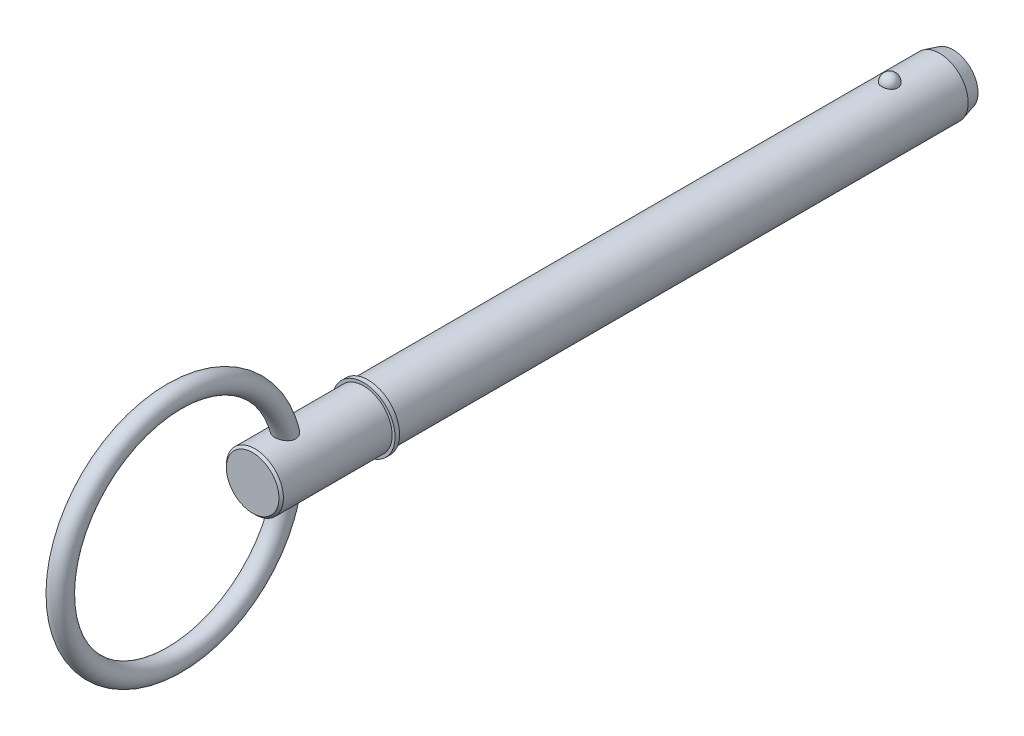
from build123d import *

# Parameters (mm, degrees)
SKETCH2_R           = 6.35
BOSS_EXTRUDE1_DEPTH = 114.3
BOSS_EXTRUDE2_START = 15.88
SKETCH3_R           = 6.35
BOSS_EXTRUDE2_DEPTH = 15.88
CHAMFER1_SIZE       = 3
CHAMFER1_SIZE2      = 0.803847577
SKETCH20_W          = 1
SKETCH20_H          = 7
SKETCH21_R          = 6.35
BOSS_EXTRUDE3_DEPTH = 25.7
CHAMFER2_SIZE       = 0.5
SKETCH24_R          = 2.25


with BuildPart() as part:
    # Sketch2 → Boss-Extrude1 (new body)
    with BuildSketch(Plane.XY):
        Circle(SKETCH2_R)
    extrude(amount=BOSS_EXTRUDE1_DEPTH)

    # Sketch3 → Boss-Extrude2 (add)
    with BuildSketch(Plane(origin=(0, 0, 0), x_dir=(-1, 0, 0), z_dir=(0, 0, -1)).offset(BOSS_EXTRUDE2_START)):
        Circle(SKETCH3_R)
    extrude(amount=-BOSS_EXTRUDE2_DEPTH)

    # Chamfer1
    chamfer1_edges = [part.edges().sort_by_distance(p)[0] for p in [
        (6.35, 0, -15.88),
    ]]
    chamfer1_side = [part.faces().sort_by_distance(p)[0] for p in [
        (6.35, 0, -7.94),
    ]]
    chamfer(chamfer1_edges, length=CHAMFER1_SIZE, length2=CHAMFER1_SIZE2, reference=chamfer1_side[0])

    # Sketch18 → Revolve1 (revolve)
    with BuildSketch(Plane(origin=(0, 0, 0), x_dir=(0, 0, -1), z_dir=(1, 0, 0))):
        with BuildLine():
            Line((1.78, 8.13), (1.78, 4.57))
            ThreePointArc((1.78, 4.57), (0, 6.35), (1.78, 8.13))
        make_face()
    revolve(axis=Axis((0, 8.13, -1.78), (0, -1, 0)))

    # Sketch20 → Revolve2 (revolve)
    with BuildSketch(Plane(origin=(0, 0, 0), x_dir=(0, 0, -1), z_dir=(1, 0, 0)), mode=Mode.PRIVATE) as revolve2_sk:
        with Locations((-114.8, 3.5)):
            Rectangle(SKETCH20_W, SKETCH20_H)
    revolve(revolve2_sk.sketch.rotate(Axis((0, 0, 33.728787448), (0, 0, 1)), 90), axis=Axis((0, 0, 33.728787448), (0, 0, 1)))

    # Sketch21 → Boss-Extrude3 (add)
    with BuildSketch(Plane(origin=(0, 0, 114.3), x_dir=(-1, 0, 0), z_dir=(0, 0, -1))):
        Circle(SKETCH21_R)
    extrude(amount=-BOSS_EXTRUDE3_DEPTH)

    # Chamfer2
    chamfer2_edges = [part.edges().sort_by_distance(p)[0] for p in [
        (6.35, 0, 140),
    ]]
    chamfer(chamfer2_edges, length=CHAMFER2_SIZE)

    # Sweep1: sweep along a path in Sketch23
    with BuildLine(Plane(origin=(0, 0, 0), x_dir=(0, 0, -1), z_dir=(1, 0, 0))) as sweep1_path:
        CenterArc((-157.4, 0), 25.4, 0, 360)
    # Sketch24 → Sweep1 (sweep)
    with BuildSketch(Plane(origin=(0, 0, 0), x_dir=(1, 0, 0), z_dir=(0, 1, 0))):
        with Locations((0, -132)):
            Circle(SKETCH24_R)
    sweep(path=sweep1_path.line)


solid = part.part
